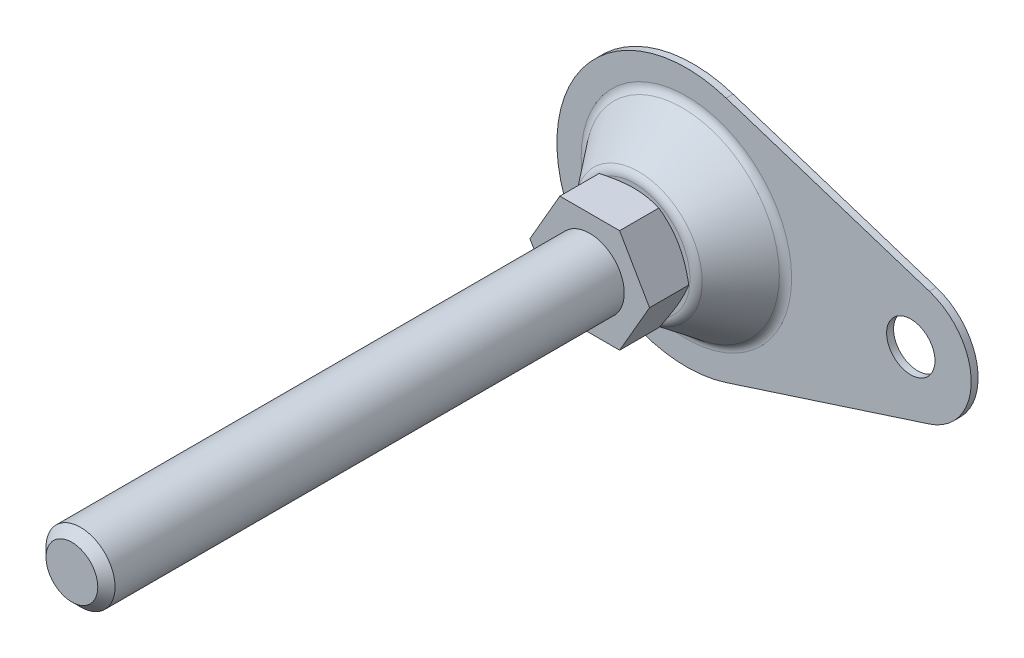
ISO-10303-21;
HEADER;
FILE_DESCRIPTION(('STEP AP214'),'2;1');
FILE_NAME('part.step','',(''),(''),'','','');
FILE_SCHEMA(('AUTOMOTIVE_DESIGN { 1 0 10303 214 1 1 1 1 }'));
ENDSEC;
DATA;
#1=APPLICATION_CONTEXT('core data for automotive mechanical design processes');
#2=APPLICATION_PROTOCOL_DEFINITION('international standard','automotive_design',2000,#1);
#3=PRODUCT_CONTEXT('',#1,'mechanical');
#4=PRODUCT('Part','Part','',(#3));
#5=PRODUCT_RELATED_PRODUCT_CATEGORY('part','',(#4));
#6=PRODUCT_DEFINITION_FORMATION('','',#4);
#7=PRODUCT_DEFINITION_CONTEXT('part definition',#1,'design');
#8=PRODUCT_DEFINITION('design','',#6,#7);
#9=PRODUCT_DEFINITION_SHAPE('','',#8);
#10=(LENGTH_UNIT() NAMED_UNIT(*) SI_UNIT(.MILLI.,.METRE.));
#11=(NAMED_UNIT(*) PLANE_ANGLE_UNIT() SI_UNIT($,.RADIAN.));
#12=(NAMED_UNIT(*) SI_UNIT($,.STERADIAN.) SOLID_ANGLE_UNIT());
#13=UNCERTAINTY_MEASURE_WITH_UNIT(LENGTH_MEASURE(1.E-05),#10,'distance_accuracy_value','');
#14=(GEOMETRIC_REPRESENTATION_CONTEXT(3) GLOBAL_UNCERTAINTY_ASSIGNED_CONTEXT((#13)) GLOBAL_UNIT_ASSIGNED_CONTEXT((#10,
#11,#12)) REPRESENTATION_CONTEXT('',''));
#15=CARTESIAN_POINT('',(0.,0.,0.));
#16=DIRECTION('',(0.,0.,1.));
#17=DIRECTION('',(1.,0.,0.));
#18=AXIS2_PLACEMENT_3D('',#15,#16,#17);
#19=CARTESIAN_POINT('',(65.,0.,2.));
#20=DIRECTION('',(0.,0.,1.));
#21=DIRECTION('',(1.,0.,0.));
#22=AXIS2_PLACEMENT_3D('',#19,#20,#21);
#23=PLANE('',#22);
#24=CARTESIAN_POINT('',(0.,0.,2.));
#25=DIRECTION('',(0.,0.,1.));
#26=DIRECTION('',(1.,0.,0.));
#27=AXIS2_PLACEMENT_3D('',#24,#25,#26);
#28=CIRCLE('',#27,30.4802116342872);
#29=CARTESIAN_POINT('',(30.4802116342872,0.,2.));
#30=VERTEX_POINT('',#29);
#31=EDGE_CURVE('E245',#30,#30,#28,.F.);
#32=ORIENTED_EDGE('',*,*,#31,.T.);
#33=EDGE_LOOP('',(#32));
#34=FACE_BOUND('',#33,.T.);
#35=CARTESIAN_POINT('',(65.,0.,2.));
#36=DIRECTION('',(0.,0.,1.));
#37=DIRECTION('',(1.,0.,0.));
#38=AXIS2_PLACEMENT_3D('',#35,#36,#37);
#39=CIRCLE('',#38,7.);
#40=CARTESIAN_POINT('',(72.,0.,2.));
#41=VERTEX_POINT('',#40);
#42=EDGE_CURVE('E262',#41,#41,#39,.T.);
#43=ORIENTED_EDGE('',*,*,#42,.F.);
#44=EDGE_LOOP('',(#43));
#45=FACE_BOUND('',#44,.T.);
#46=DIRECTION('',(-0.951485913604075,0.307692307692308,0.));
#47=VECTOR('',#46,1.);
#48=CARTESIAN_POINT('',(11.5384615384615,35.6807217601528,2.));
#49=LINE('',#48,#47);
#50=CARTESIAN_POINT('',(70.3846153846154,16.6510034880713,2.));
#51=VERTEX_POINT('',#50);
#52=CARTESIAN_POINT('',(11.5384615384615,35.6807217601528,2.));
#53=VERTEX_POINT('',#52);
#54=EDGE_CURVE('E112',#51,#53,#49,.T.);
#55=ORIENTED_EDGE('',*,*,#54,.T.);
#56=CARTESIAN_POINT('',(0.,0.,2.));
#57=DIRECTION('',(0.,0.,1.));
#58=DIRECTION('',(1.,0.,0.));
#59=AXIS2_PLACEMENT_3D('',#56,#57,#58);
#60=CIRCLE('',#59,37.5);
#61=CARTESIAN_POINT('',(11.5384615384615,-35.6807217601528,2.));
#62=VERTEX_POINT('',#61);
#63=EDGE_CURVE('E114',#53,#62,#60,.T.);
#64=ORIENTED_EDGE('',*,*,#63,.T.);
#65=DIRECTION('',(0.951485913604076,0.307692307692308,0.));
#66=VECTOR('',#65,1.);
#67=CARTESIAN_POINT('',(11.5384615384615,-35.6807217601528,2.));
#68=LINE('',#67,#66);
#69=CARTESIAN_POINT('',(70.3846153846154,-16.6510034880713,2.));
#70=VERTEX_POINT('',#69);
#71=EDGE_CURVE('E97',#62,#70,#68,.T.);
#72=ORIENTED_EDGE('',*,*,#71,.T.);
#73=CARTESIAN_POINT('',(65.,0.,2.));
#74=DIRECTION('',(0.,0.,1.));
#75=DIRECTION('',(1.,0.,0.));
#76=AXIS2_PLACEMENT_3D('',#73,#74,#75);
#77=CIRCLE('',#76,17.5);
#78=EDGE_CURVE('E106',#70,#51,#77,.T.);
#79=ORIENTED_EDGE('',*,*,#78,.T.);
#80=EDGE_LOOP('',(#55,#64,#72,#79));
#81=FACE_BOUND('',#80,.T.);
#82=ADVANCED_FACE('F14',(#34,#45,#81),#23,.T.);
#83=CARTESIAN_POINT('',(65.,0.,0.));
#84=DIRECTION('',(0.,0.,1.));
#85=DIRECTION('',(1.,0.,0.));
#86=AXIS2_PLACEMENT_3D('',#83,#84,#85);
#87=PLANE('',#86);
#88=CARTESIAN_POINT('',(65.,0.,0.));
#89=DIRECTION('',(0.,0.,1.));
#90=DIRECTION('',(1.,0.,0.));
#91=AXIS2_PLACEMENT_3D('',#88,#89,#90);
#92=CIRCLE('',#91,7.);
#93=CARTESIAN_POINT('',(72.,0.,0.));
#94=VERTEX_POINT('',#93);
#95=EDGE_CURVE('E258',#94,#94,#92,.T.);
#96=ORIENTED_EDGE('',*,*,#95,.T.);
#97=EDGE_LOOP('',(#96));
#98=FACE_BOUND('',#97,.T.);
#99=CARTESIAN_POINT('',(0.,0.,0.));
#100=DIRECTION('',(0.,0.,1.));
#101=DIRECTION('',(1.,0.,0.));
#102=AXIS2_PLACEMENT_3D('',#99,#100,#101);
#103=CIRCLE('',#102,37.5);
#104=CARTESIAN_POINT('',(11.5384615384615,35.6807217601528,0.));
#105=VERTEX_POINT('',#104);
#106=CARTESIAN_POINT('',(11.5384615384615,-35.6807217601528,0.));
#107=VERTEX_POINT('',#106);
#108=EDGE_CURVE('E275',#105,#107,#103,.T.);
#109=ORIENTED_EDGE('',*,*,#108,.F.);
#110=DIRECTION('',(-0.951485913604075,0.307692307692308,0.));
#111=VECTOR('',#110,1.);
#112=CARTESIAN_POINT('',(70.3846153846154,16.6510034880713,0.));
#113=LINE('',#112,#111);
#114=CARTESIAN_POINT('',(70.3846153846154,16.6510034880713,0.));
#115=VERTEX_POINT('',#114);
#116=EDGE_CURVE('E9',#115,#105,#113,.T.);
#117=ORIENTED_EDGE('',*,*,#116,.F.);
#118=CARTESIAN_POINT('',(65.,0.,0.));
#119=DIRECTION('',(0.,0.,1.));
#120=DIRECTION('',(1.,0.,0.));
#121=AXIS2_PLACEMENT_3D('',#118,#119,#120);
#122=CIRCLE('',#121,17.5);
#123=CARTESIAN_POINT('',(70.3846153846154,-16.6510034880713,0.));
#124=VERTEX_POINT('',#123);
#125=EDGE_CURVE('E22',#124,#115,#122,.T.);
#126=ORIENTED_EDGE('',*,*,#125,.F.);
#127=DIRECTION('',(0.951485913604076,0.307692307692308,0.));
#128=VECTOR('',#127,1.);
#129=CARTESIAN_POINT('',(70.3846153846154,-16.6510034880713,0.));
#130=LINE('',#129,#128);
#131=EDGE_CURVE('E99',#107,#124,#130,.T.);
#132=ORIENTED_EDGE('',*,*,#131,.F.);
#133=EDGE_LOOP('',(#109,#117,#126,#132));
#134=FACE_BOUND('',#133,.T.);
#135=ADVANCED_FACE('F215',(#98,#134),#87,.F.);
#136=CARTESIAN_POINT('',(0.,0.,17.));
#137=DIRECTION('',(0.,0.,-1.));
#138=DIRECTION('',(-1.,0.,0.));
#139=AXIS2_PLACEMENT_3D('',#136,#137,#138);
#140=PLANE('',#139);
#141=CARTESIAN_POINT('',(0.,0.,17.));
#142=DIRECTION('',(0.,0.,-1.));
#143=DIRECTION('',(-1.,0.,0.));
#144=AXIS2_PLACEMENT_3D('',#141,#142,#143);
#145=CIRCLE('',#144,16.0197883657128);
#146=CARTESIAN_POINT('',(-16.0197883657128,0.,17.));
#147=VERTEX_POINT('',#146);
#148=EDGE_CURVE('E278',#147,#147,#145,.F.);
#149=ORIENTED_EDGE('',*,*,#148,.T.);
#150=EDGE_LOOP('',(#149));
#151=FACE_BOUND('',#150,.T.);
#152=CARTESIAN_POINT('',(0.,0.,17.));
#153=DIRECTION('',(0.,0.,-1.));
#154=DIRECTION('',(-1.,0.,0.));
#155=AXIS2_PLACEMENT_3D('',#152,#153,#154);
#156=CIRCLE('',#155,14.5);
#157=CARTESIAN_POINT('',(-14.5,0.,17.));
#158=VERTEX_POINT('',#157);
#159=EDGE_CURVE('E122',#158,#158,#156,.T.);
#160=ORIENTED_EDGE('',*,*,#159,.T.);
#161=EDGE_LOOP('',(#160));
#162=FACE_BOUND('',#161,.T.);
#163=ADVANCED_FACE('F211',(#151,#162),#140,.F.);
#164=CARTESIAN_POINT('',(0.,0.,5.));
#165=DIRECTION('',(0.,0.,1.));
#166=DIRECTION('',(1.,0.,0.));
#167=AXIS2_PLACEMENT_3D('',#164,#165,#166);
#168=TOROIDAL_SURFACE('',#167,30.4802116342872,3.);
#169=CARTESIAN_POINT('',(0.,0.,3.1747053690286));
#170=DIRECTION('',(0.,0.,1.));
#171=DIRECTION('',(1.,0.,0.));
#172=AXIS2_PLACEMENT_3D('',#169,#170,#171);
#173=CIRCLE('',#172,28.0993925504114);
#174=CARTESIAN_POINT('',(28.0993925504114,0.,3.1747053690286));
#175=VERTEX_POINT('',#174);
#176=EDGE_CURVE('E242',#175,#175,#173,.T.);
#177=ORIENTED_EDGE('',*,*,#176,.F.);
#178=EDGE_LOOP('',(#177));
#179=FACE_BOUND('',#178,.T.);
#180=ORIENTED_EDGE('',*,*,#31,.F.);
#181=EDGE_LOOP('',(#180));
#182=FACE_BOUND('',#181,.T.);
#183=ADVANCED_FACE('F214',(#179,#182),#168,.F.);
#184=CARTESIAN_POINT('',(0.,0.,14.));
#185=DIRECTION('',(0.,0.,-1.));
#186=DIRECTION('',(-1.,0.,0.));
#187=AXIS2_PLACEMENT_3D('',#184,#185,#186);
#188=TOROIDAL_SURFACE('',#187,16.0197883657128,3.);
#189=ORIENTED_EDGE('',*,*,#148,.F.);
#190=EDGE_LOOP('',(#189));
#191=FACE_BOUND('',#190,.T.);
#192=CARTESIAN_POINT('',(0.,0.,15.8252946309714));
#193=DIRECTION('',(0.,0.,1.));
#194=DIRECTION('',(1.,0.,0.));
#195=AXIS2_PLACEMENT_3D('',#192,#193,#194);
#196=CIRCLE('',#195,18.4006074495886);
#197=CARTESIAN_POINT('',(18.4006074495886,0.,15.8252946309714));
#198=VERTEX_POINT('',#197);
#199=EDGE_CURVE('E251',#198,#198,#196,.F.);
#200=ORIENTED_EDGE('',*,*,#199,.F.);
#201=EDGE_LOOP('',(#200));
#202=FACE_BOUND('',#201,.T.);
#203=ADVANCED_FACE('F229',(#191,#202),#188,.T.);
#204=CARTESIAN_POINT('',(0.,0.,2.));
#205=DIRECTION('',(0.,0.,-1.));
#206=DIRECTION('',(-1.,0.,0.));
#207=AXIS2_PLACEMENT_3D('',#204,#205,#206);
#208=CYLINDRICAL_SURFACE('',#207,37.5);
#209=ORIENTED_EDGE('',*,*,#108,.T.);
#210=DIRECTION('',(0.,0.,1.));
#211=VECTOR('',#210,1.);
#212=CARTESIAN_POINT('',(11.5384615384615,-35.6807217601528,-8.));
#213=LINE('',#212,#211);
#214=EDGE_CURVE('E103',#107,#62,#213,.T.);
#215=ORIENTED_EDGE('',*,*,#214,.T.);
#216=ORIENTED_EDGE('',*,*,#63,.F.);
#217=DIRECTION('',(0.,0.,1.));
#218=VECTOR('',#217,1.);
#219=CARTESIAN_POINT('',(11.5384615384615,35.6807217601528,-8.));
#220=LINE('',#219,#218);
#221=EDGE_CURVE('E119',#105,#53,#220,.T.);
#222=ORIENTED_EDGE('',*,*,#221,.F.);
#223=EDGE_LOOP('',(#209,#215,#216,#222));
#224=FACE_BOUND('',#223,.T.);
#225=ADVANCED_FACE('F219',(#224),#208,.T.);
#226=CARTESIAN_POINT('',(65.,0.,2.));
#227=DIRECTION('',(0.,0.,-1.));
#228=DIRECTION('',(-1.,0.,0.));
#229=AXIS2_PLACEMENT_3D('',#226,#227,#228);
#230=CYLINDRICAL_SURFACE('',#229,7.);
#231=ORIENTED_EDGE('',*,*,#42,.T.);
#232=EDGE_LOOP('',(#231));
#233=FACE_BOUND('',#232,.T.);
#234=ORIENTED_EDGE('',*,*,#95,.F.);
#235=EDGE_LOOP('',(#234));
#236=FACE_BOUND('',#235,.T.);
#237=ADVANCED_FACE('F209',(#233,#236),#230,.F.);
#238=CARTESIAN_POINT('',(0.,0.,2.));
#239=DIRECTION('',(0.,0.,-1.));
#240=DIRECTION('',(-1.,0.,0.));
#241=AXIS2_PLACEMENT_3D('',#238,#239,#240);
#242=CONICAL_SURFACE('',#241,29.,0.654082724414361);
#243=ORIENTED_EDGE('',*,*,#176,.T.);
#244=EDGE_LOOP('',(#243));
#245=FACE_BOUND('',#244,.T.);
#246=ORIENTED_EDGE('',*,*,#199,.T.);
#247=EDGE_LOOP('',(#246));
#248=FACE_BOUND('',#247,.T.);
#249=ADVANCED_FACE('F151',(#245,#248),#242,.T.);
#250=CARTESIAN_POINT('',(0.,0.,17.));
#251=DIRECTION('',(0.,0.,1.));
#252=DIRECTION('',(1.,0.,0.));
#253=AXIS2_PLACEMENT_3D('',#250,#251,#252);
#254=CONICAL_SURFACE('',#253,14.5,1.0471975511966);
#255=ORIENTED_EDGE('',*,*,#159,.F.);
#256=EDGE_LOOP('',(#255));
#257=FACE_BOUND('',#256,.T.);
#258=CARTESIAN_POINT('',(17.3206235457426,0.0002,18.6284877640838));
#259=CARTESIAN_POINT('',(17.130274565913,-0.329494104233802,18.5185969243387));
#260=CARTESIAN_POINT('',(16.939183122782,-0.660474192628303,18.4136927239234));
#261=CARTESIAN_POINT('',(16.5554679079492,-1.32508844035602,18.2152437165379));
#262=CARTESIAN_POINT('',(16.3628436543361,-1.6587234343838,18.1217026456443));
#263=CARTESIAN_POINT('',(15.9756905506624,-2.32929228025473,17.9472372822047));
#264=CARTESIAN_POINT('',(15.7811583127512,-2.66623200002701,17.866342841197));
#265=CARTESIAN_POINT('',(15.3907420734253,-3.34245276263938,17.7189077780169));
#266=CARTESIAN_POINT('',(15.1948581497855,-3.68173367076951,17.6523663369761));
#267=CARTESIAN_POINT('',(14.8067578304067,-4.35394314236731,17.5364675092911));
#268=CARTESIAN_POINT('',(14.6145702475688,-4.68682180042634,17.4867265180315));
#269=CARTESIAN_POINT('',(14.2293144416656,-5.35410443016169,17.4033218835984));
#270=CARTESIAN_POINT('',(14.0362462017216,-5.68850843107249,17.3696585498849));
#271=CARTESIAN_POINT('',(13.6497853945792,-6.35787818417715,17.3192592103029));
#272=CARTESIAN_POINT('',(13.4563934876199,-6.69284279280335,17.3025030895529));
#273=CARTESIAN_POINT('',(13.0694311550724,-7.363081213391,17.2862785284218));
#274=CARTESIAN_POINT('',(12.8758607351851,-7.69835501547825,17.2868095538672));
#275=CARTESIAN_POINT('',(12.5139822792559,-8.3251468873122,17.303951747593));
#276=CARTESIAN_POINT('',(12.3456484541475,-8.61670962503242,17.3184719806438));
#277=CARTESIAN_POINT('',(12.0093680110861,-9.19916443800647,17.3603122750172));
#278=CARTESIAN_POINT('',(11.8414214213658,-9.49005646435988,17.3876332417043));
#279=CARTESIAN_POINT('',(11.5060066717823,-10.0710118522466,17.4545986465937));
#280=CARTESIAN_POINT('',(11.338539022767,-10.3610743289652,17.4942532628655));
#281=CARTESIAN_POINT('',(11.0043888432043,-10.939839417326,17.5851902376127));
#282=CARTESIAN_POINT('',(10.8377063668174,-11.2285419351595,17.6364733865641));
#283=CARTESIAN_POINT('',(10.3317324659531,-12.1049144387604,17.8090619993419));
#284=CARTESIAN_POINT('',(9.99390625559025,-12.6900465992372,17.9475763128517));
#285=CARTESIAN_POINT('',(9.32329122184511,-13.8515859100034,18.26194710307));
#286=CARTESIAN_POINT('',(8.99049381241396,-14.4280079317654,18.4377297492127));
#287=CARTESIAN_POINT('',(8.66013856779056,-15.0002,18.6284877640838));
#288=B_SPLINE_CURVE_WITH_KNOTS('',3,(#258,#259,#260,#261,#262,#263,#264,#265,#266,#267,#268,
#269,#270,#271,#272,#273,#274,#275,#276,#277,#278,#279,#280,#281,#282,#283,#284,#285,#286,#287),
.UNSPECIFIED.,.F.,.F.,(4,2,2,2,2,2,2,2,2,2,2,2,2,2,4),(0.,1.18875411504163,2.37789802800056,
3.56980778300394,4.76164951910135,5.92407379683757,7.0865204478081,8.24758247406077,
9.40860862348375,10.4193068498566,11.4300765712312,12.4416826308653,13.4533574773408,
15.5211962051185,17.5849760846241),.UNSPECIFIED.);
#289=CARTESIAN_POINT('',(17.3205080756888,0.,18.6284210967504));
#290=VERTEX_POINT('',#289);
#291=CARTESIAN_POINT('',(8.66025403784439,-15.,18.6284210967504));
#292=VERTEX_POINT('',#291);
#293=EDGE_CURVE('E29',#290,#292,#288,.T.);
#294=ORIENTED_EDGE('',*,*,#293,.T.);
#295=CARTESIAN_POINT('',(-23.2672807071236,-15.,24.6113948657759));
#296=CARTESIAN_POINT('',(-22.9396434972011,-15.,24.4524116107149));
#297=CARTESIAN_POINT('',(-22.6116218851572,-15.,24.294220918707));
#298=CARTESIAN_POINT('',(-21.9547296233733,-15.,23.9796041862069));
#299=CARTESIAN_POINT('',(-21.6258589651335,-15.,23.8231781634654));
#300=CARTESIAN_POINT('',(-20.637765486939,-15.,23.3567751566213));
#301=CARTESIAN_POINT('',(-19.9771580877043,-15.,23.0497203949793));
#302=CARTESIAN_POINT('',(-18.6479314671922,-15.,22.4436084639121));
#303=CARTESIAN_POINT('',(-17.979288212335,-15.,22.1446038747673));
#304=CARTESIAN_POINT('',(-16.6366845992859,-15.,21.5588233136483));
#305=CARTESIAN_POINT('',(-15.9627244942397,-15.,21.2720467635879));
#306=CARTESIAN_POINT('',(-14.5868700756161,-15.,20.7050805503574));
#307=CARTESIAN_POINT('',(-13.8847689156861,-15.,20.42539022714));
#308=CARTESIAN_POINT('',(-12.4723500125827,-15.,19.8871650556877));
#309=CARTESIAN_POINT('',(-11.7620313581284,-15.,19.6286325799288));
#310=CARTESIAN_POINT('',(-10.3333974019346,-15.,19.1395087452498));
#311=CARTESIAN_POINT('',(-9.61510158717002,-15.,18.9088609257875));
#312=CARTESIAN_POINT('',(-8.16813976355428,-15.,18.4828901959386));
#313=CARTESIAN_POINT('',(-7.43947709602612,-15.,18.2875561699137));
#314=CARTESIAN_POINT('',(-6.34053558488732,-15.,18.0286241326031));
#315=CARTESIAN_POINT('',(-5.97420669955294,-15.,17.9481597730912));
#316=CARTESIAN_POINT('',(-5.23904491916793,-15.,17.7995541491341));
#317=CARTESIAN_POINT('',(-4.87021207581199,-15.,17.7314126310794));
#318=CARTESIAN_POINT('',(-4.13029667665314,-15.,17.6086552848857));
#319=CARTESIAN_POINT('',(-3.7592141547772,-15.,17.5540392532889));
#320=CARTESIAN_POINT('',(-3.01519358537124,-15.,17.4594223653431));
#321=CARTESIAN_POINT('',(-2.64225561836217,-15.,17.4194208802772));
#322=CARTESIAN_POINT('',(-1.8999177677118,-15.,17.3553294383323));
#323=CARTESIAN_POINT('',(-1.53053535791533,-15.,17.3310383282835));
#324=CARTESIAN_POINT('',(-0.791075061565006,-15.,17.2980986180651));
#325=CARTESIAN_POINT('',(-0.420997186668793,-15.,17.2894497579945));
#326=CARTESIAN_POINT('',(0.319197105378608,-15.,17.2880002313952));
#327=CARTESIAN_POINT('',(0.689313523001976,-15.,17.2951997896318));
#328=CARTESIAN_POINT('',(1.42891307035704,-15.,17.3252718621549));
#329=CARTESIAN_POINT('',(1.79839617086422,-15.,17.348145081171));
#330=CARTESIAN_POINT('',(2.68603402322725,-15.,17.4214377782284));
#331=CARTESIAN_POINT('',(3.20358711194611,-15.,17.4792741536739));
#332=CARTESIAN_POINT('',(4.23486015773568,-15.,17.6225533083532));
#333=CARTESIAN_POINT('',(4.74857958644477,-15.,17.7079998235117));
#334=CARTESIAN_POINT('',(5.77168467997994,-15.,17.9034599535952));
#335=CARTESIAN_POINT('',(6.28106673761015,-15.,18.0134922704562));
#336=CARTESIAN_POINT('',(7.29472660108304,-15.,18.2547689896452));
#337=CARTESIAN_POINT('',(7.79900448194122,-15.,18.3860130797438));
#338=CARTESIAN_POINT('',(8.81394772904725,-15.,18.669735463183));
#339=CARTESIAN_POINT('',(9.32449582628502,-15.,18.8226303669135));
#340=CARTESIAN_POINT('',(10.3405604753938,-15.,19.1442290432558));
#341=CARTESIAN_POINT('',(10.8460769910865,-15.,19.3129329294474));
#342=CARTESIAN_POINT('',(11.8523335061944,-15.,19.6634691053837));
#343=CARTESIAN_POINT('',(12.3530749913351,-15.,19.8452971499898));
#344=CARTESIAN_POINT('',(13.3504021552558,-15.,20.2199407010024));
#345=CARTESIAN_POINT('',(13.8469879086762,-15.,20.4127560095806));
#346=CARTESIAN_POINT('',(15.1207082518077,-15.,20.9209401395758));
#347=CARTESIAN_POINT('',(15.8951375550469,-15.,21.2430832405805));
#348=CARTESIAN_POINT('',(17.4366276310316,-15.,21.9045975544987));
#349=CARTESIAN_POINT('',(18.203687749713,-15.,22.2439702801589));
#350=CARTESIAN_POINT('',(19.732018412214,-15.,22.9360868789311));
#351=CARTESIAN_POINT('',(20.4932870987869,-15.,23.2888348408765));
#352=CARTESIAN_POINT('',(22.0108973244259,-15.,24.0046832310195));
#353=CARTESIAN_POINT('',(22.7672390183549,-15.,24.3677833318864));
#354=CARTESIAN_POINT('',(24.2769483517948,-15.,25.1026976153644));
#355=CARTESIAN_POINT('',(25.0303105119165,-15.,25.4745230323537));
#356=CARTESIAN_POINT('',(26.5337353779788,-15.,26.2247872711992));
#357=CARTESIAN_POINT('',(27.2837980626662,-15.,26.6032261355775));
#358=CARTESIAN_POINT('',(28.7810541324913,-15.,27.3654109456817));
#359=CARTESIAN_POINT('',(29.5282479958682,-15.,27.7491559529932));
#360=CARTESIAN_POINT('',(31.0203431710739,-15.,28.5210680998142));
#361=CARTESIAN_POINT('',(31.765244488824,-15.,28.9092352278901));
#362=CARTESIAN_POINT('',(33.8526102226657,-15.,30.0034936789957));
#363=CARTESIAN_POINT('',(35.1929061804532,-15.,30.7137208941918));
#364=CARTESIAN_POINT('',(37.8688973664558,-15.,32.1429280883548));
#365=CARTESIAN_POINT('',(39.2045923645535,-15.,32.8619084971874));
#366=CARTESIAN_POINT('',(41.8685021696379,-15.,34.3043404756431));
#367=CARTESIAN_POINT('',(43.1967274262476,-15.,35.0277727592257));
#368=CARTESIAN_POINT('',(45.1869423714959,-15.,36.1166923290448));
#369=CARTESIAN_POINT('',(45.8499717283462,-15.,36.4802820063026));
#370=CARTESIAN_POINT('',(47.1754097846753,-15.,37.2085889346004));
#371=CARTESIAN_POINT('',(47.8378184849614,-15.,37.5733061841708));
#372=CARTESIAN_POINT('',(48.4999538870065,-15.,37.9385190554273));
#373=B_SPLINE_CURVE_WITH_KNOTS('',3,(#295,#296,#297,#298,#299,#300,#301,#302,#303,#304,#305,
#306,#307,#308,#309,#310,#311,#312,#313,#314,#315,#316,#317,#318,#319,#320,#321,#322,#323,#324,
#325,#326,#327,#328,#329,#330,#331,#332,#333,#334,#335,#336,#337,#338,#339,#340,#341,#342,#343,
#344,#345,#346,#347,#348,#349,#350,#351,#352,#353,#354,#355,#356,#357,#358,#359,#360,#361,#362,
#363,#364,#365,#366,#367,#368,#369,#370,#371,#372),.UNSPECIFIED.,.F.,.F.,(4,2,2,2,2,2,2,2,2,2,2,
2,2,2,2,2,2,2,2,2,2,2,2,2,2,2,2,2,2,2,2,2,2,2,2,2,2,2,4),(0.,1.09251637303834,2.18504372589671,
4.37042178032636,6.56768569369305,8.76484561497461,11.031864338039,13.2991369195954,
15.5617390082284,17.8236276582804,18.948639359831,20.0736279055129,21.1985995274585,
22.3235227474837,23.433741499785,24.5439418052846,25.6541578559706,26.7644238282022,
28.3258846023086,29.8875567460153,31.4504208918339,33.0132620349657,34.6118073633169,
36.2103641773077,37.80840621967,39.4064194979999,41.9223940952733,44.4385899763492,
46.9555613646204,49.4724532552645,51.9927859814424,54.5131349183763,57.0330436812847,
59.5529459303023,64.1034281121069,68.654134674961,73.1915007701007,75.4600343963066,
77.7285650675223),.UNSPECIFIED.);
#374=CARTESIAN_POINT('',(-8.6602540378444,-15.,18.6284210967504));
#375=VERTEX_POINT('',#374);
#376=EDGE_CURVE('E158',#292,#375,#373,.F.);
#377=ORIENTED_EDGE('',*,*,#376,.T.);
#378=CARTESIAN_POINT('',(-8.66013856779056,-15.0002,18.6284877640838));
#379=CARTESIAN_POINT('',(-8.85048754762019,-14.6705058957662,18.5185969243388));
#380=CARTESIAN_POINT('',(-9.04157899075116,-14.3395258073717,18.4136927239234));
#381=CARTESIAN_POINT('',(-9.42529420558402,-13.674911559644,18.2152437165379));
#382=CARTESIAN_POINT('',(-9.61791845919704,-13.3412765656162,18.1217026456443));
#383=CARTESIAN_POINT('',(-10.0050715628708,-12.6707077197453,17.9472372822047));
#384=CARTESIAN_POINT('',(-10.199603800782,-12.333767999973,17.866342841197));
#385=CARTESIAN_POINT('',(-10.5900200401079,-11.6575472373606,17.7189077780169));
#386=CARTESIAN_POINT('',(-10.7859039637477,-11.3182663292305,17.6523663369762));
#387=CARTESIAN_POINT('',(-11.1740042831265,-10.6460568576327,17.5364675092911));
#388=CARTESIAN_POINT('',(-11.3661918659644,-10.3131781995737,17.4867265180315));
#389=CARTESIAN_POINT('',(-11.7514476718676,-9.64589556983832,17.4033218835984));
#390=CARTESIAN_POINT('',(-11.9445159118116,-9.31149156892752,17.3696585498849));
#391=CARTESIAN_POINT('',(-12.3309767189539,-8.64212181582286,17.3192592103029));
#392=CARTESIAN_POINT('',(-12.5243686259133,-8.30715720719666,17.3025030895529));
#393=CARTESIAN_POINT('',(-12.9113309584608,-7.63691878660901,17.2862785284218));
#394=CARTESIAN_POINT('',(-13.1049013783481,-7.30164498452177,17.2868095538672));
#395=CARTESIAN_POINT('',(-13.4667798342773,-6.67485311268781,17.303951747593));
#396=CARTESIAN_POINT('',(-13.6351136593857,-6.38329037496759,17.3184719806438));
#397=CARTESIAN_POINT('',(-13.9713941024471,-5.80083556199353,17.3603122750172));
#398=CARTESIAN_POINT('',(-14.1393406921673,-5.50994353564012,17.3876332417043));
#399=CARTESIAN_POINT('',(-14.4747554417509,-4.92898814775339,17.4545986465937));
#400=CARTESIAN_POINT('',(-14.6422230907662,-4.63892567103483,17.4942532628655));
#401=CARTESIAN_POINT('',(-14.9763732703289,-4.06016058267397,17.5851902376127));
#402=CARTESIAN_POINT('',(-15.1430557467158,-3.77145806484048,17.6364733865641));
#403=CARTESIAN_POINT('',(-15.6490296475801,-2.8950855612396,17.8090619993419));
#404=CARTESIAN_POINT('',(-15.9868558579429,-2.30995340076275,17.9475763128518));
#405=CARTESIAN_POINT('',(-16.6574708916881,-1.14841408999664,18.26194710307));
#406=CARTESIAN_POINT('',(-16.9902683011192,-0.571992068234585,18.4377297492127));
#407=CARTESIAN_POINT('',(-17.3206235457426,0.000199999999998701,18.6284877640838));
#408=B_SPLINE_CURVE_WITH_KNOTS('',3,(#378,#379,#380,#381,#382,#383,#384,#385,#386,#387,#388,
#389,#390,#391,#392,#393,#394,#395,#396,#397,#398,#399,#400,#401,#402,#403,#404,#405,#406,#407),
.UNSPECIFIED.,.F.,.F.,(4,2,2,2,2,2,2,2,2,2,2,2,2,2,4),(0.,1.18875411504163,2.37789802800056,
3.56980778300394,4.76164951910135,5.92407379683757,7.0865204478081,8.24758247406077,
9.40860862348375,10.4193068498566,11.4300765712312,12.4416826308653,13.4533574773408,
15.5211962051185,17.5849760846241),.UNSPECIFIED.);
#409=CARTESIAN_POINT('',(-17.3205080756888,0.,18.6284210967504));
#410=VERTEX_POINT('',#409);
#411=EDGE_CURVE('E127',#375,#410,#408,.T.);
#412=ORIENTED_EDGE('',*,*,#411,.T.);
#413=CARTESIAN_POINT('',(-17.3206235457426,-0.000199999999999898,18.6284877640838));
#414=CARTESIAN_POINT('',(-17.130274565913,0.329494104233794,18.5185969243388));
#415=CARTESIAN_POINT('',(-16.939183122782,0.660474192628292,18.4136927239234));
#416=CARTESIAN_POINT('',(-16.5554679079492,1.32508844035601,18.2152437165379));
#417=CARTESIAN_POINT('',(-16.3628436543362,1.65872343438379,18.1217026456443));
#418=CARTESIAN_POINT('',(-15.9756905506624,2.32929228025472,17.9472372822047));
#419=CARTESIAN_POINT('',(-15.7811583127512,2.66623200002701,17.866342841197));
#420=CARTESIAN_POINT('',(-15.3907420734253,3.34245276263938,17.7189077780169));
#421=CARTESIAN_POINT('',(-15.1948581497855,3.68173367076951,17.6523663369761));
#422=CARTESIAN_POINT('',(-14.8067578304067,4.35394314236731,17.5364675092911));
#423=CARTESIAN_POINT('',(-14.6145702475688,4.68682180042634,17.4867265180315));
#424=CARTESIAN_POINT('',(-14.2293144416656,5.3541044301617,17.4033218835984));
#425=CARTESIAN_POINT('',(-14.0362462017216,5.68850843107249,17.3696585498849));
#426=CARTESIAN_POINT('',(-13.6497853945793,6.35787818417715,17.3192592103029));
#427=CARTESIAN_POINT('',(-13.4563934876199,6.69284279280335,17.3025030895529));
#428=CARTESIAN_POINT('',(-13.0694311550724,7.36308121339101,17.2862785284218));
#429=CARTESIAN_POINT('',(-12.8758607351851,7.69835501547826,17.2868095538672));
#430=CARTESIAN_POINT('',(-12.5139822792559,8.32514688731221,17.303951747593));
#431=CARTESIAN_POINT('',(-12.3456484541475,8.61670962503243,17.3184719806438));
#432=CARTESIAN_POINT('',(-12.0093680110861,9.19916443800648,17.3603122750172));
#433=CARTESIAN_POINT('',(-11.8414214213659,9.49005646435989,17.3876332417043));
#434=CARTESIAN_POINT('',(-11.5060066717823,10.0710118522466,17.4545986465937));
#435=CARTESIAN_POINT('',(-11.338539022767,10.3610743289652,17.4942532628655));
#436=CARTESIAN_POINT('',(-11.0043888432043,10.939839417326,17.5851902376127));
#437=CARTESIAN_POINT('',(-10.8377063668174,11.2285419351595,17.6364733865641));
#438=CARTESIAN_POINT('',(-10.3317324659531,12.1049144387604,17.8090619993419));
#439=CARTESIAN_POINT('',(-9.99390625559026,12.6900465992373,17.9475763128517));
#440=CARTESIAN_POINT('',(-9.32329122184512,13.8515859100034,18.26194710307));
#441=CARTESIAN_POINT('',(-8.99049381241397,14.4280079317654,18.4377297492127));
#442=CARTESIAN_POINT('',(-8.66013856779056,15.0002,18.6284877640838));
#443=B_SPLINE_CURVE_WITH_KNOTS('',3,(#413,#414,#415,#416,#417,#418,#419,#420,#421,#422,#423,
#424,#425,#426,#427,#428,#429,#430,#431,#432,#433,#434,#435,#436,#437,#438,#439,#440,#441,#442),
.UNSPECIFIED.,.F.,.F.,(4,2,2,2,2,2,2,2,2,2,2,2,2,2,4),(0.,1.18875411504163,2.37789802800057,
3.56980778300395,4.76164951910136,5.92407379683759,7.08652044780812,8.24758247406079,
9.40860862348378,10.4193068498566,11.4300765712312,12.4416826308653,13.4533574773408,
15.5211962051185,17.5849760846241),.UNSPECIFIED.);
#444=CARTESIAN_POINT('',(-8.6602540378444,15.,18.6284210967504));
#445=VERTEX_POINT('',#444);
#446=EDGE_CURVE('E135',#410,#445,#443,.T.);
#447=ORIENTED_EDGE('',*,*,#446,.T.);
#448=CARTESIAN_POINT('',(-23.2672807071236,15.,24.611394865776));
#449=CARTESIAN_POINT('',(-22.9396434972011,15.,24.4524116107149));
#450=CARTESIAN_POINT('',(-22.6116218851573,15.,24.2942209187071));
#451=CARTESIAN_POINT('',(-21.9547296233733,15.,23.9796041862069));
#452=CARTESIAN_POINT('',(-21.6258589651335,15.,23.8231781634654));
#453=CARTESIAN_POINT('',(-20.637765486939,15.,23.3567751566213));
#454=CARTESIAN_POINT('',(-19.9771580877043,15.,23.0497203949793));
#455=CARTESIAN_POINT('',(-18.6479314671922,15.,22.4436084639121));
#456=CARTESIAN_POINT('',(-17.979288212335,15.,22.1446038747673));
#457=CARTESIAN_POINT('',(-16.6366845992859,15.,21.5588233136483));
#458=CARTESIAN_POINT('',(-15.9627244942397,15.,21.2720467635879));
#459=CARTESIAN_POINT('',(-14.5868700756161,15.,20.7050805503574));
#460=CARTESIAN_POINT('',(-13.8847689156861,15.,20.42539022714));
#461=CARTESIAN_POINT('',(-12.4723500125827,15.,19.8871650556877));
#462=CARTESIAN_POINT('',(-11.7620313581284,15.,19.6286325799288));
#463=CARTESIAN_POINT('',(-10.3333974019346,15.,19.1395087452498));
#464=CARTESIAN_POINT('',(-9.61510158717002,15.,18.9088609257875));
#465=CARTESIAN_POINT('',(-8.16813976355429,15.,18.4828901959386));
#466=CARTESIAN_POINT('',(-7.43947709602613,15.,18.2875561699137));
#467=CARTESIAN_POINT('',(-6.34053558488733,15.,18.0286241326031));
#468=CARTESIAN_POINT('',(-5.97420669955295,15.,17.9481597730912));
#469=CARTESIAN_POINT('',(-5.23904491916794,15.,17.7995541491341));
#470=CARTESIAN_POINT('',(-4.870212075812,15.,17.7314126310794));
#471=CARTESIAN_POINT('',(-4.13029667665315,15.,17.6086552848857));
#472=CARTESIAN_POINT('',(-3.7592141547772,15.,17.5540392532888));
#473=CARTESIAN_POINT('',(-3.01519358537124,15.,17.4594223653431));
#474=CARTESIAN_POINT('',(-2.64225561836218,15.,17.4194208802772));
#475=CARTESIAN_POINT('',(-1.8999177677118,15.,17.3553294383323));
#476=CARTESIAN_POINT('',(-1.53053535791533,15.,17.3310383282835));
#477=CARTESIAN_POINT('',(-0.791075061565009,15.,17.298098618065));
#478=CARTESIAN_POINT('',(-0.420997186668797,15.,17.2894497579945));
#479=CARTESIAN_POINT('',(0.319197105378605,15.,17.2880002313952));
#480=CARTESIAN_POINT('',(0.689313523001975,15.,17.2951997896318));
#481=CARTESIAN_POINT('',(1.42891307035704,15.,17.3252718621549));
#482=CARTESIAN_POINT('',(1.79839617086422,15.,17.348145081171));
#483=CARTESIAN_POINT('',(2.68603402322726,15.,17.4214377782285));
#484=CARTESIAN_POINT('',(3.20358711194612,15.,17.4792741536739));
#485=CARTESIAN_POINT('',(4.23486015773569,15.,17.6225533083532));
#486=CARTESIAN_POINT('',(4.74857958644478,15.,17.7079998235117));
#487=CARTESIAN_POINT('',(5.77168467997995,15.,17.9034599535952));
#488=CARTESIAN_POINT('',(6.28106673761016,15.,18.0134922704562));
#489=CARTESIAN_POINT('',(7.29472660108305,15.,18.2547689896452));
#490=CARTESIAN_POINT('',(7.79900448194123,15.,18.3860130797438));
#491=CARTESIAN_POINT('',(8.81394772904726,15.,18.669735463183));
#492=CARTESIAN_POINT('',(9.32449582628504,15.,18.8226303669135));
#493=CARTESIAN_POINT('',(10.3405604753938,15.,19.1442290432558));
#494=CARTESIAN_POINT('',(10.8460769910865,15.,19.3129329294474));
#495=CARTESIAN_POINT('',(11.8523335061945,15.,19.6634691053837));
#496=CARTESIAN_POINT('',(12.3530749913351,15.,19.8452971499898));
#497=CARTESIAN_POINT('',(13.3504021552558,15.,20.2199407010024));
#498=CARTESIAN_POINT('',(13.8469879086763,15.,20.4127560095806));
#499=CARTESIAN_POINT('',(15.1207082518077,15.,20.9209401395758));
#500=CARTESIAN_POINT('',(15.8951375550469,15.,21.2430832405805));
#501=CARTESIAN_POINT('',(17.4366276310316,15.,21.9045975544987));
#502=CARTESIAN_POINT('',(18.203687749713,15.,22.2439702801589));
#503=CARTESIAN_POINT('',(19.732018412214,15.,22.9360868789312));
#504=CARTESIAN_POINT('',(20.4932870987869,15.,23.2888348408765));
#505=CARTESIAN_POINT('',(22.0108973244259,15.,24.0046832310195));
#506=CARTESIAN_POINT('',(22.7672390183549,15.,24.3677833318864));
#507=CARTESIAN_POINT('',(24.2769483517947,15.,25.1026976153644));
#508=CARTESIAN_POINT('',(25.0303105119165,15.,25.4745230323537));
#509=CARTESIAN_POINT('',(26.5337353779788,15.,26.2247872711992));
#510=CARTESIAN_POINT('',(27.2837980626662,15.,26.6032261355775));
#511=CARTESIAN_POINT('',(28.7810541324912,15.,27.3654109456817));
#512=CARTESIAN_POINT('',(29.5282479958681,15.,27.7491559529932));
#513=CARTESIAN_POINT('',(31.0203431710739,15.,28.5210680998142));
#514=CARTESIAN_POINT('',(31.7652444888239,15.,28.9092352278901));
#515=CARTESIAN_POINT('',(33.8526102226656,15.,30.0034936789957));
#516=CARTESIAN_POINT('',(35.1929061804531,15.,30.7137208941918));
#517=CARTESIAN_POINT('',(37.8688973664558,15.,32.1429280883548));
#518=CARTESIAN_POINT('',(39.2045923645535,15.,32.8619084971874));
#519=CARTESIAN_POINT('',(41.8685021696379,15.,34.3043404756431));
#520=CARTESIAN_POINT('',(43.1967274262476,15.,35.0277727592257));
#521=CARTESIAN_POINT('',(45.1869423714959,15.,36.1166923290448));
#522=CARTESIAN_POINT('',(45.8499717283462,15.,36.4802820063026));
#523=CARTESIAN_POINT('',(47.1754097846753,15.,37.2085889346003));
#524=CARTESIAN_POINT('',(47.8378184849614,15.,37.5733061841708));
#525=CARTESIAN_POINT('',(48.4999538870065,15.,37.9385190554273));
#526=B_SPLINE_CURVE_WITH_KNOTS('',3,(#448,#449,#450,#451,#452,#453,#454,#455,#456,#457,#458,
#459,#460,#461,#462,#463,#464,#465,#466,#467,#468,#469,#470,#471,#472,#473,#474,#475,#476,#477,
#478,#479,#480,#481,#482,#483,#484,#485,#486,#487,#488,#489,#490,#491,#492,#493,#494,#495,#496,
#497,#498,#499,#500,#501,#502,#503,#504,#505,#506,#507,#508,#509,#510,#511,#512,#513,#514,#515,
#516,#517,#518,#519,#520,#521,#522,#523,#524,#525),.UNSPECIFIED.,.F.,.F.,(4,2,2,2,2,2,2,2,2,2,2,
2,2,2,2,2,2,2,2,2,2,2,2,2,2,2,2,2,2,2,2,2,2,2,2,2,2,2,4),(0.,1.09251637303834,2.18504372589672,
4.37042178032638,6.56768569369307,8.76484561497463,11.0318643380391,13.2991369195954,
15.5617390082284,17.8236276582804,18.948639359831,20.0736279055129,21.1985995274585,
22.3235227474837,23.433741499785,24.5439418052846,25.6541578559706,26.7644238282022,
28.3258846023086,29.8875567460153,31.4504208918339,33.0132620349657,34.6118073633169,
36.2103641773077,37.80840621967,39.4064194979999,41.9223940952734,44.4385899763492,
46.9555613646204,49.4724532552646,51.9927859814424,54.5131349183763,57.0330436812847,
59.5529459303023,64.1034281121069,68.6541346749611,73.1915007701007,75.4600343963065,
77.7285650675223),.UNSPECIFIED.);
#527=CARTESIAN_POINT('',(8.66025403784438,15.,18.6284210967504));
#528=VERTEX_POINT('',#527);
#529=EDGE_CURVE('E169',#445,#528,#526,.T.);
#530=ORIENTED_EDGE('',*,*,#529,.T.);
#531=CARTESIAN_POINT('',(8.66013856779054,15.0002,18.6284877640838));
#532=CARTESIAN_POINT('',(8.85048754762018,14.6705058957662,18.5185969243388));
#533=CARTESIAN_POINT('',(9.04157899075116,14.3395258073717,18.4136927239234));
#534=CARTESIAN_POINT('',(9.42529420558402,13.674911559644,18.2152437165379));
#535=CARTESIAN_POINT('',(9.61791845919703,13.3412765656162,18.1217026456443));
#536=CARTESIAN_POINT('',(10.0050715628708,12.6707077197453,17.9472372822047));
#537=CARTESIAN_POINT('',(10.199603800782,12.333767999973,17.866342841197));
#538=CARTESIAN_POINT('',(10.5900200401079,11.6575472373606,17.7189077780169));
#539=CARTESIAN_POINT('',(10.7859039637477,11.3182663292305,17.6523663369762));
#540=CARTESIAN_POINT('',(11.1740042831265,10.6460568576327,17.5364675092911));
#541=CARTESIAN_POINT('',(11.3661918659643,10.3131781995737,17.4867265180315));
#542=CARTESIAN_POINT('',(11.7514476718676,9.64589556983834,17.4033218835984));
#543=CARTESIAN_POINT('',(11.9445159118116,9.31149156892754,17.3696585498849));
#544=CARTESIAN_POINT('',(12.3309767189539,8.64212181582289,17.3192592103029));
#545=CARTESIAN_POINT('',(12.5243686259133,8.3071572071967,17.3025030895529));
#546=CARTESIAN_POINT('',(12.9113309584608,7.63691878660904,17.2862785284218));
#547=CARTESIAN_POINT('',(13.104901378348,7.30164498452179,17.2868095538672));
#548=CARTESIAN_POINT('',(13.4667798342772,6.67485311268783,17.303951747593));
#549=CARTESIAN_POINT('',(13.6351136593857,6.38329037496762,17.3184719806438));
#550=CARTESIAN_POINT('',(13.9713941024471,5.80083556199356,17.3603122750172));
#551=CARTESIAN_POINT('',(14.1393406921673,5.50994353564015,17.3876332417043));
#552=CARTESIAN_POINT('',(14.4747554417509,4.92898814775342,17.4545986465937));
#553=CARTESIAN_POINT('',(14.6422230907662,4.63892567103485,17.4942532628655));
#554=CARTESIAN_POINT('',(14.9763732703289,4.060160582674,17.5851902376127));
#555=CARTESIAN_POINT('',(15.1430557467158,3.7714580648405,17.6364733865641));
#556=CARTESIAN_POINT('',(15.6490296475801,2.89508556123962,17.8090619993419));
#557=CARTESIAN_POINT('',(15.9868558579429,2.30995340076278,17.9475763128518));
#558=CARTESIAN_POINT('',(16.6574708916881,1.14841408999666,18.26194710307));
#559=CARTESIAN_POINT('',(16.9902683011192,0.5719920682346,18.4377297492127));
#560=CARTESIAN_POINT('',(17.3206235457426,-0.000199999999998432,18.6284877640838));
#561=B_SPLINE_CURVE_WITH_KNOTS('',3,(#531,#532,#533,#534,#535,#536,#537,#538,#539,#540,#541,
#542,#543,#544,#545,#546,#547,#548,#549,#550,#551,#552,#553,#554,#555,#556,#557,#558,#559,#560),
.UNSPECIFIED.,.F.,.F.,(4,2,2,2,2,2,2,2,2,2,2,2,2,2,4),(0.,1.18875411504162,2.37789802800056,
3.56980778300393,4.76164951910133,5.92407379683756,7.08652044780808,8.24758247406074,
9.40860862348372,10.4193068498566,11.4300765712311,12.4416826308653,13.4533574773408,
15.5211962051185,17.5849760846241),.UNSPECIFIED.);
#562=EDGE_CURVE('E176',#528,#290,#561,.T.);
#563=ORIENTED_EDGE('',*,*,#562,.T.);
#564=EDGE_LOOP('',(#294,#377,#412,#447,#530,#563));
#565=FACE_BOUND('',#564,.T.);
#566=ADVANCED_FACE('F145',(#257,#565),#254,.T.);
#567=CARTESIAN_POINT('',(0.,0.,180.));
#568=DIRECTION('',(0.,0.,1.));
#569=DIRECTION('',(1.,0.,0.));
#570=AXIS2_PLACEMENT_3D('',#567,#568,#569);
#571=PLANE('',#570);
#572=CARTESIAN_POINT('',(0.,0.,180.));
#573=DIRECTION('',(0.,0.,1.));
#574=DIRECTION('',(1.,0.,0.));
#575=AXIS2_PLACEMENT_3D('',#572,#573,#574);
#576=CIRCLE('',#575,7.5);
#577=CARTESIAN_POINT('',(7.5,0.,180.));
#578=VERTEX_POINT('',#577);
#579=EDGE_CURVE('E246',#578,#578,#576,.T.);
#580=ORIENTED_EDGE('',*,*,#579,.T.);
#581=EDGE_LOOP('',(#580));
#582=FACE_BOUND('',#581,.T.);
#583=ADVANCED_FACE('F150',(#582),#571,.T.);
#584=CARTESIAN_POINT('',(0.,0.,180.));
#585=DIRECTION('',(0.,0.,-1.));
#586=DIRECTION('',(-1.,0.,0.));
#587=AXIS2_PLACEMENT_3D('',#584,#585,#586);
#588=CONICAL_SURFACE('',#587,7.5,0.785398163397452);
#589=CARTESIAN_POINT('',(0.,0.,177.5));
#590=DIRECTION('',(0.,0.,1.));
#591=DIRECTION('',(1.,0.,0.));
#592=AXIS2_PLACEMENT_3D('',#589,#590,#591);
#593=CIRCLE('',#592,10.);
#594=CARTESIAN_POINT('',(10.,0.,177.5));
#595=VERTEX_POINT('',#594);
#596=EDGE_CURVE('E249',#595,#595,#593,.F.);
#597=ORIENTED_EDGE('',*,*,#596,.F.);
#598=EDGE_LOOP('',(#597));
#599=FACE_BOUND('',#598,.T.);
#600=ORIENTED_EDGE('',*,*,#579,.F.);
#601=EDGE_LOOP('',(#600));
#602=FACE_BOUND('',#601,.T.);
#603=ADVANCED_FACE('F16',(#599,#602),#588,.T.);
#604=CARTESIAN_POINT('',(0.,0.,180.));
#605=DIRECTION('',(0.,0.,-1.));
#606=DIRECTION('',(-1.,0.,0.));
#607=AXIS2_PLACEMENT_3D('',#604,#605,#606);
#608=CYLINDRICAL_SURFACE('',#607,10.);
#609=CARTESIAN_POINT('',(0.,0.,30.));
#610=DIRECTION('',(0.,0.,1.));
#611=DIRECTION('',(1.,0.,0.));
#612=AXIS2_PLACEMENT_3D('',#609,#610,#611);
#613=CIRCLE('',#612,10.);
#614=CARTESIAN_POINT('',(10.,0.,30.));
#615=VERTEX_POINT('',#614);
#616=EDGE_CURVE('E256',#615,#615,#613,.T.);
#617=ORIENTED_EDGE('',*,*,#616,.T.);
#618=EDGE_LOOP('',(#617));
#619=FACE_BOUND('',#618,.T.);
#620=ORIENTED_EDGE('',*,*,#596,.T.);
#621=EDGE_LOOP('',(#620));
#622=FACE_BOUND('',#621,.T.);
#623=ADVANCED_FACE('F203',(#619,#622),#608,.T.);
#624=CARTESIAN_POINT('',(0.,0.,30.));
#625=DIRECTION('',(0.,0.,1.));
#626=DIRECTION('',(1.,0.,0.));
#627=AXIS2_PLACEMENT_3D('',#624,#625,#626);
#628=PLANE('',#627);
#629=DIRECTION('',(0.5,0.866025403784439,0.));
#630=VECTOR('',#629,1.);
#631=CARTESIAN_POINT('',(8.66025403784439,-15.,30.));
#632=LINE('',#631,#630);
#633=CARTESIAN_POINT('',(8.66025403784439,-15.,30.));
#634=VERTEX_POINT('',#633);
#635=CARTESIAN_POINT('',(17.3205080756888,0.,30.));
#636=VERTEX_POINT('',#635);
#637=EDGE_CURVE('E321',#634,#636,#632,.T.);
#638=ORIENTED_EDGE('',*,*,#637,.T.);
#639=DIRECTION('',(-0.5,0.866025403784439,0.));
#640=VECTOR('',#639,1.);
#641=CARTESIAN_POINT('',(17.3205080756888,0.,30.));
#642=LINE('',#641,#640);
#643=CARTESIAN_POINT('',(8.66025403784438,15.,30.));
#644=VERTEX_POINT('',#643);
#645=EDGE_CURVE('E320',#636,#644,#642,.T.);
#646=ORIENTED_EDGE('',*,*,#645,.T.);
#647=DIRECTION('',(-1.,0.,0.));
#648=VECTOR('',#647,1.);
#649=CARTESIAN_POINT('',(8.66025403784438,15.,30.));
#650=LINE('',#649,#648);
#651=CARTESIAN_POINT('',(-8.6602540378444,15.,30.));
#652=VERTEX_POINT('',#651);
#653=EDGE_CURVE('E318',#644,#652,#650,.T.);
#654=ORIENTED_EDGE('',*,*,#653,.T.);
#655=DIRECTION('',(-0.5,-0.866025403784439,0.));
#656=VECTOR('',#655,1.);
#657=CARTESIAN_POINT('',(-8.6602540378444,15.,30.));
#658=LINE('',#657,#656);
#659=CARTESIAN_POINT('',(-17.3205080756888,0.,30.));
#660=VERTEX_POINT('',#659);
#661=EDGE_CURVE('E314',#652,#660,#658,.T.);
#662=ORIENTED_EDGE('',*,*,#661,.T.);
#663=DIRECTION('',(0.5,-0.866025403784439,0.));
#664=VECTOR('',#663,1.);
#665=CARTESIAN_POINT('',(-17.3205080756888,0.,30.));
#666=LINE('',#665,#664);
#667=CARTESIAN_POINT('',(-8.6602540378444,-15.,30.));
#668=VERTEX_POINT('',#667);
#669=EDGE_CURVE('E328',#660,#668,#666,.T.);
#670=ORIENTED_EDGE('',*,*,#669,.T.);
#671=DIRECTION('',(1.,0.,0.));
#672=VECTOR('',#671,1.);
#673=CARTESIAN_POINT('',(-8.6602540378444,-15.,30.));
#674=LINE('',#673,#672);
#675=EDGE_CURVE('E37',#668,#634,#674,.T.);
#676=ORIENTED_EDGE('',*,*,#675,.T.);
#677=EDGE_LOOP('',(#638,#646,#654,#662,#670,#676));
#678=FACE_BOUND('',#677,.T.);
#679=ORIENTED_EDGE('',*,*,#616,.F.);
#680=EDGE_LOOP('',(#679));
#681=FACE_BOUND('',#680,.T.);
#682=ADVANCED_FACE('F154',(#678,#681),#628,.T.);
#683=CARTESIAN_POINT('',(-8.6602540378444,-15.,30.));
#684=DIRECTION('',(0.,1.,0.));
#685=DIRECTION('',(0.,0.,1.));
#686=AXIS2_PLACEMENT_3D('',#683,#684,#685);
#687=PLANE('',#686);
#688=ORIENTED_EDGE('',*,*,#376,.F.);
#689=DIRECTION('',(0.,0.,-1.));
#690=VECTOR('',#689,1.);
#691=CARTESIAN_POINT('',(8.66025403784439,-15.,30.));
#692=LINE('',#691,#690);
#693=EDGE_CURVE('E304',#634,#292,#692,.T.);
#694=ORIENTED_EDGE('',*,*,#693,.F.);
#695=ORIENTED_EDGE('',*,*,#675,.F.);
#696=DIRECTION('',(0.,0.,-1.));
#697=VECTOR('',#696,1.);
#698=CARTESIAN_POINT('',(-8.6602540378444,-15.,30.));
#699=LINE('',#698,#697);
#700=EDGE_CURVE('E300',#668,#375,#699,.T.);
#701=ORIENTED_EDGE('',*,*,#700,.T.);
#702=EDGE_LOOP('',(#688,#694,#695,#701));
#703=FACE_BOUND('',#702,.T.);
#704=ADVANCED_FACE('F303',(#703),#687,.F.);
#705=CARTESIAN_POINT('',(-17.3205080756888,0.,30.));
#706=DIRECTION('',(0.866025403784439,0.5,0.));
#707=DIRECTION('',(-0.5,0.866025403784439,0.));
#708=AXIS2_PLACEMENT_3D('',#705,#706,#707);
#709=PLANE('',#708);
#710=ORIENTED_EDGE('',*,*,#411,.F.);
#711=ORIENTED_EDGE('',*,*,#700,.F.);
#712=ORIENTED_EDGE('',*,*,#669,.F.);
#713=DIRECTION('',(0.,0.,-1.));
#714=VECTOR('',#713,1.);
#715=CARTESIAN_POINT('',(-17.3205080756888,0.,30.));
#716=LINE('',#715,#714);
#717=EDGE_CURVE('E302',#660,#410,#716,.T.);
#718=ORIENTED_EDGE('',*,*,#717,.T.);
#719=EDGE_LOOP('',(#710,#711,#712,#718));
#720=FACE_BOUND('',#719,.T.);
#721=ADVANCED_FACE('F142',(#720),#709,.F.);
#722=CARTESIAN_POINT('',(-8.6602540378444,15.,30.));
#723=DIRECTION('',(0.866025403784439,-0.5,0.));
#724=DIRECTION('',(0.5,0.866025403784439,0.));
#725=AXIS2_PLACEMENT_3D('',#722,#723,#724);
#726=PLANE('',#725);
#727=ORIENTED_EDGE('',*,*,#446,.F.);
#728=ORIENTED_EDGE('',*,*,#717,.F.);
#729=ORIENTED_EDGE('',*,*,#661,.F.);
#730=DIRECTION('',(0.,0.,-1.));
#731=VECTOR('',#730,1.);
#732=CARTESIAN_POINT('',(-8.6602540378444,15.,30.));
#733=LINE('',#732,#731);
#734=EDGE_CURVE('E270',#652,#445,#733,.T.);
#735=ORIENTED_EDGE('',*,*,#734,.T.);
#736=EDGE_LOOP('',(#727,#728,#729,#735));
#737=FACE_BOUND('',#736,.T.);
#738=ADVANCED_FACE('F313',(#737),#726,.F.);
#739=CARTESIAN_POINT('',(8.66025403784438,15.,30.));
#740=DIRECTION('',(0.,-1.,0.));
#741=DIRECTION('',(1.,0.,0.));
#742=AXIS2_PLACEMENT_3D('',#739,#740,#741);
#743=PLANE('',#742);
#744=ORIENTED_EDGE('',*,*,#529,.F.);
#745=ORIENTED_EDGE('',*,*,#734,.F.);
#746=ORIENTED_EDGE('',*,*,#653,.F.);
#747=DIRECTION('',(0.,0.,-1.));
#748=VECTOR('',#747,1.);
#749=CARTESIAN_POINT('',(8.66025403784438,15.,30.));
#750=LINE('',#749,#748);
#751=EDGE_CURVE('E265',#644,#528,#750,.T.);
#752=ORIENTED_EDGE('',*,*,#751,.T.);
#753=EDGE_LOOP('',(#744,#745,#746,#752));
#754=FACE_BOUND('',#753,.T.);
#755=ADVANCED_FACE('F192',(#754),#743,.F.);
#756=CARTESIAN_POINT('',(17.3205080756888,0.,30.));
#757=DIRECTION('',(-0.866025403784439,-0.5,0.));
#758=DIRECTION('',(0.5,-0.866025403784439,0.));
#759=AXIS2_PLACEMENT_3D('',#756,#757,#758);
#760=PLANE('',#759);
#761=ORIENTED_EDGE('',*,*,#562,.F.);
#762=ORIENTED_EDGE('',*,*,#751,.F.);
#763=ORIENTED_EDGE('',*,*,#645,.F.);
#764=DIRECTION('',(0.,0.,-1.));
#765=VECTOR('',#764,1.);
#766=CARTESIAN_POINT('',(17.3205080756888,0.,30.));
#767=LINE('',#766,#765);
#768=EDGE_CURVE('E259',#636,#290,#767,.T.);
#769=ORIENTED_EDGE('',*,*,#768,.T.);
#770=EDGE_LOOP('',(#761,#762,#763,#769));
#771=FACE_BOUND('',#770,.T.);
#772=ADVANCED_FACE('F188',(#771),#760,.F.);
#773=CARTESIAN_POINT('',(8.66025403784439,-15.,30.));
#774=DIRECTION('',(-0.866025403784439,0.5,0.));
#775=DIRECTION('',(-0.5,-0.866025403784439,0.));
#776=AXIS2_PLACEMENT_3D('',#773,#774,#775);
#777=PLANE('',#776);
#778=ORIENTED_EDGE('',*,*,#293,.F.);
#779=ORIENTED_EDGE('',*,*,#768,.F.);
#780=ORIENTED_EDGE('',*,*,#637,.F.);
#781=ORIENTED_EDGE('',*,*,#693,.T.);
#782=EDGE_LOOP('',(#778,#779,#780,#781));
#783=FACE_BOUND('',#782,.T.);
#784=ADVANCED_FACE('F191',(#783),#777,.F.);
#785=CARTESIAN_POINT('',(11.5384615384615,35.6807217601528,-8.));
#786=DIRECTION('',(0.307692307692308,0.951485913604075,0.));
#787=DIRECTION('',(-0.951485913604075,0.307692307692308,0.));
#788=AXIS2_PLACEMENT_3D('',#785,#786,#787);
#789=PLANE('',#788);
#790=ORIENTED_EDGE('',*,*,#116,.T.);
#791=ORIENTED_EDGE('',*,*,#221,.T.);
#792=ORIENTED_EDGE('',*,*,#54,.F.);
#793=DIRECTION('',(0.,0.,1.));
#794=VECTOR('',#793,1.);
#795=CARTESIAN_POINT('',(70.3846153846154,16.6510034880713,-8.));
#796=LINE('',#795,#794);
#797=EDGE_CURVE('E102',#115,#51,#796,.T.);
#798=ORIENTED_EDGE('',*,*,#797,.F.);
#799=EDGE_LOOP('',(#790,#791,#792,#798));
#800=FACE_BOUND('',#799,.T.);
#801=ADVANCED_FACE('F198',(#800),#789,.T.);
#802=CARTESIAN_POINT('',(65.,0.,-8.));
#803=DIRECTION('',(0.,0.,1.));
#804=DIRECTION('',(1.,0.,0.));
#805=AXIS2_PLACEMENT_3D('',#802,#803,#804);
#806=CYLINDRICAL_SURFACE('',#805,17.5);
#807=ORIENTED_EDGE('',*,*,#125,.T.);
#808=ORIENTED_EDGE('',*,*,#797,.T.);
#809=ORIENTED_EDGE('',*,*,#78,.F.);
#810=DIRECTION('',(0.,0.,1.));
#811=VECTOR('',#810,1.);
#812=CARTESIAN_POINT('',(70.3846153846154,-16.6510034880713,-8.));
#813=LINE('',#812,#811);
#814=EDGE_CURVE('E92',#124,#70,#813,.T.);
#815=ORIENTED_EDGE('',*,*,#814,.F.);
#816=EDGE_LOOP('',(#807,#808,#809,#815));
#817=FACE_BOUND('',#816,.T.);
#818=ADVANCED_FACE('F107',(#817),#806,.T.);
#819=CARTESIAN_POINT('',(11.5384615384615,-35.6807217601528,-8.));
#820=DIRECTION('',(0.307692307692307,-0.951485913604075,0.));
#821=DIRECTION('',(0.951485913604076,0.307692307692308,0.));
#822=AXIS2_PLACEMENT_3D('',#819,#820,#821);
#823=PLANE('',#822);
#824=ORIENTED_EDGE('',*,*,#131,.T.);
#825=ORIENTED_EDGE('',*,*,#814,.T.);
#826=ORIENTED_EDGE('',*,*,#71,.F.);
#827=ORIENTED_EDGE('',*,*,#214,.F.);
#828=EDGE_LOOP('',(#824,#825,#826,#827));
#829=FACE_BOUND('',#828,.T.);
#830=ADVANCED_FACE('F94',(#829),#823,.T.);
#831=CLOSED_SHELL('',(#82,#135,#163,#183,#203,#225,#237,#249,#566,#583,#603,#623,#682,#704,#721,
#738,#755,#772,#784,#801,#818,#830));
#832=MANIFOLD_SOLID_BREP('B1',#831);
#833=ADVANCED_BREP_SHAPE_REPRESENTATION('',(#18,#832),#14);
#834=SHAPE_DEFINITION_REPRESENTATION(#9,#833);
ENDSEC;
END-ISO-10303-21;
